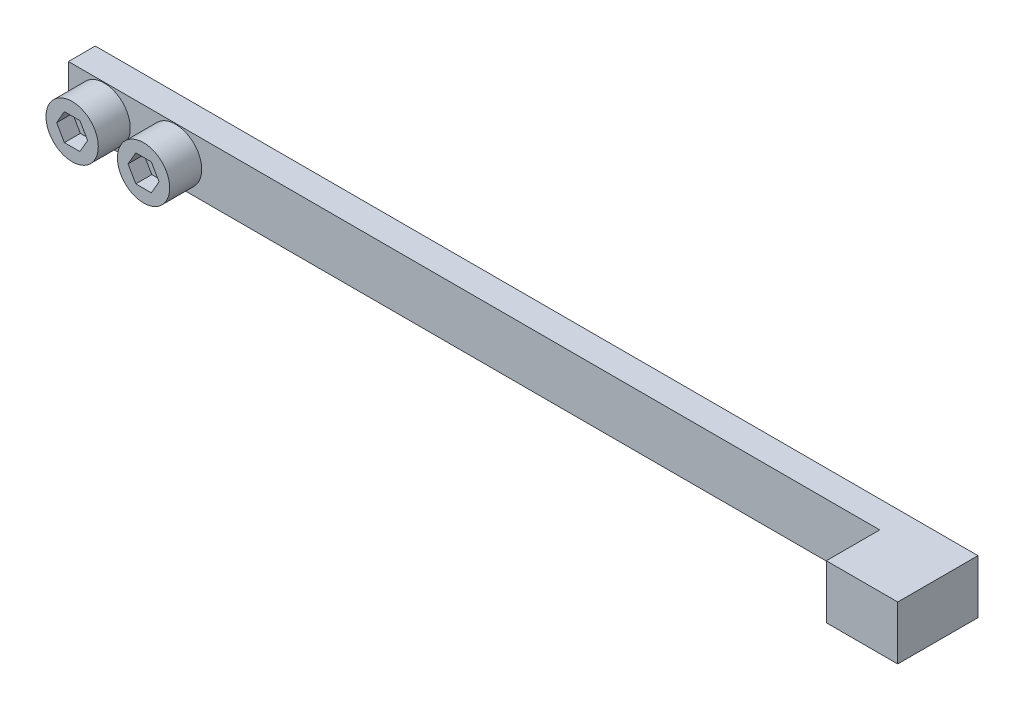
ISO-10303-21;
HEADER;
FILE_DESCRIPTION(('STEP AP214'),'2;1');
FILE_NAME('part.step','',(''),(''),'','','');
FILE_SCHEMA(('AUTOMOTIVE_DESIGN { 1 0 10303 214 1 1 1 1 }'));
ENDSEC;
DATA;
#1=APPLICATION_CONTEXT('core data for automotive mechanical design processes');
#2=APPLICATION_PROTOCOL_DEFINITION('international standard','automotive_design',2000,#1);
#3=PRODUCT_CONTEXT('',#1,'mechanical');
#4=PRODUCT('Part','Part','',(#3));
#5=PRODUCT_RELATED_PRODUCT_CATEGORY('part','',(#4));
#6=PRODUCT_DEFINITION_FORMATION('','',#4);
#7=PRODUCT_DEFINITION_CONTEXT('part definition',#1,'design');
#8=PRODUCT_DEFINITION('design','',#6,#7);
#9=PRODUCT_DEFINITION_SHAPE('','',#8);
#10=(LENGTH_UNIT() NAMED_UNIT(*) SI_UNIT(.MILLI.,.METRE.));
#11=(NAMED_UNIT(*) PLANE_ANGLE_UNIT() SI_UNIT($,.RADIAN.));
#12=(NAMED_UNIT(*) SI_UNIT($,.STERADIAN.) SOLID_ANGLE_UNIT());
#13=UNCERTAINTY_MEASURE_WITH_UNIT(LENGTH_MEASURE(1.E-05),#10,'distance_accuracy_value','');
#14=(GEOMETRIC_REPRESENTATION_CONTEXT(3) GLOBAL_UNCERTAINTY_ASSIGNED_CONTEXT((#13)) GLOBAL_UNIT_ASSIGNED_CONTEXT((#10,
#11,#12)) REPRESENTATION_CONTEXT('',''));
#15=CARTESIAN_POINT('',(0.,0.,0.));
#16=DIRECTION('',(0.,0.,1.));
#17=DIRECTION('',(1.,0.,0.));
#18=AXIS2_PLACEMENT_3D('',#15,#16,#17);
#19=CARTESIAN_POINT('',(-38.4048,2.3876,1.1938));
#20=DIRECTION('',(0.,0.,-1.));
#21=DIRECTION('',(-1.,0.,0.));
#22=AXIS2_PLACEMENT_3D('',#19,#20,#21);
#23=PLANE('',#22);
#24=CARTESIAN_POINT('',(-35.2298,0.,1.1938));
#25=DIRECTION('',(0.,0.,-1.));
#26=DIRECTION('',(-1.,0.,0.));
#27=AXIS2_PLACEMENT_3D('',#24,#25,#26);
#28=CIRCLE('',#27,2.3241);
#29=CARTESIAN_POINT('',(-37.5539,0.,1.1938));
#30=VERTEX_POINT('',#29);
#31=EDGE_CURVE('E41',#30,#30,#28,.F.);
#32=ORIENTED_EDGE('',*,*,#31,.F.);
#33=EDGE_LOOP('',(#32));
#34=FACE_BOUND('',#33,.T.);
#35=DIRECTION('',(1.,0.,0.));
#36=VECTOR('',#35,1.);
#37=CARTESIAN_POINT('',(-38.4048,-2.3876,1.1938));
#38=LINE('',#37,#36);
#39=CARTESIAN_POINT('',(-38.4048,-2.3876,1.1938));
#40=VERTEX_POINT('',#39);
#41=CARTESIAN_POINT('',(33.7312,-2.3876,1.1938));
#42=VERTEX_POINT('',#41);
#43=EDGE_CURVE('E284',#40,#42,#38,.T.);
#44=ORIENTED_EDGE('',*,*,#43,.T.);
#45=DIRECTION('',(0.,-1.,0.));
#46=VECTOR('',#45,1.);
#47=CARTESIAN_POINT('',(33.7312,2.3876,1.1938));
#48=LINE('',#47,#46);
#49=CARTESIAN_POINT('',(33.7312,2.3876,1.1938));
#50=VERTEX_POINT('',#49);
#51=EDGE_CURVE('E299',#50,#42,#48,.T.);
#52=ORIENTED_EDGE('',*,*,#51,.F.);
#53=DIRECTION('',(1.,0.,0.));
#54=VECTOR('',#53,1.);
#55=CARTESIAN_POINT('',(-38.4048,2.3876,1.1938));
#56=LINE('',#55,#54);
#57=CARTESIAN_POINT('',(-38.4048,2.3876,1.1938));
#58=VERTEX_POINT('',#57);
#59=EDGE_CURVE('E271',#58,#50,#56,.T.);
#60=ORIENTED_EDGE('',*,*,#59,.F.);
#61=DIRECTION('',(0.,-1.,0.));
#62=VECTOR('',#61,1.);
#63=CARTESIAN_POINT('',(-38.4048,2.3876,1.1938));
#64=LINE('',#63,#62);
#65=EDGE_CURVE('E302',#58,#40,#64,.T.);
#66=ORIENTED_EDGE('',*,*,#65,.T.);
#67=EDGE_LOOP('',(#44,#52,#60,#66));
#68=FACE_BOUND('',#67,.T.);
#69=CARTESIAN_POINT('',(-28.8798,0.,1.1938));
#70=DIRECTION('',(0.,0.,-1.));
#71=DIRECTION('',(-1.,0.,0.));
#72=AXIS2_PLACEMENT_3D('',#69,#70,#71);
#73=CIRCLE('',#72,2.3241);
#74=CARTESIAN_POINT('',(-31.2039,0.,1.1938));
#75=VERTEX_POINT('',#74);
#76=EDGE_CURVE('E11',#75,#75,#73,.F.);
#77=ORIENTED_EDGE('',*,*,#76,.F.);
#78=EDGE_LOOP('',(#77));
#79=FACE_BOUND('',#78,.T.);
#80=ADVANCED_FACE('F33',(#34,#68,#79),#23,.F.);
#81=CARTESIAN_POINT('',(40.0812,2.3876,-1.1938));
#82=DIRECTION('',(0.,0.,1.));
#83=DIRECTION('',(1.,0.,0.));
#84=AXIS2_PLACEMENT_3D('',#81,#82,#83);
#85=PLANE('',#84);
#86=DIRECTION('',(-1.,0.,0.));
#87=VECTOR('',#86,1.);
#88=CARTESIAN_POINT('',(40.0812,-2.3876,-1.1938));
#89=LINE('',#88,#87);
#90=CARTESIAN_POINT('',(40.0812,-2.3876,-1.1938));
#91=VERTEX_POINT('',#90);
#92=CARTESIAN_POINT('',(-38.4048,-2.3876,-1.1938));
#93=VERTEX_POINT('',#92);
#94=EDGE_CURVE('E264',#91,#93,#89,.T.);
#95=ORIENTED_EDGE('',*,*,#94,.T.);
#96=DIRECTION('',(0.,-1.,0.));
#97=VECTOR('',#96,1.);
#98=CARTESIAN_POINT('',(-38.4048,2.3876,-1.1938));
#99=LINE('',#98,#97);
#100=CARTESIAN_POINT('',(-38.4048,2.3876,-1.1938));
#101=VERTEX_POINT('',#100);
#102=EDGE_CURVE('E305',#101,#93,#99,.T.);
#103=ORIENTED_EDGE('',*,*,#102,.F.);
#104=DIRECTION('',(-1.,0.,0.));
#105=VECTOR('',#104,1.);
#106=CARTESIAN_POINT('',(40.0812,2.3876,-1.1938));
#107=LINE('',#106,#105);
#108=CARTESIAN_POINT('',(40.0812,2.3876,-1.1938));
#109=VERTEX_POINT('',#108);
#110=EDGE_CURVE('E265',#109,#101,#107,.T.);
#111=ORIENTED_EDGE('',*,*,#110,.F.);
#112=DIRECTION('',(0.,-1.,0.));
#113=VECTOR('',#112,1.);
#114=CARTESIAN_POINT('',(40.0812,2.3876,-1.1938));
#115=LINE('',#114,#113);
#116=EDGE_CURVE('E279',#109,#91,#115,.T.);
#117=ORIENTED_EDGE('',*,*,#116,.T.);
#118=EDGE_LOOP('',(#95,#103,#111,#117));
#119=FACE_BOUND('',#118,.T.);
#120=ADVANCED_FACE('F35',(#119),#85,.F.);
#121=CARTESIAN_POINT('',(-38.4048,2.3876,-1.1938));
#122=DIRECTION('',(1.,0.,0.));
#123=DIRECTION('',(0.,0.,-1.));
#124=AXIS2_PLACEMENT_3D('',#121,#122,#123);
#125=PLANE('',#124);
#126=DIRECTION('',(0.,0.,1.));
#127=VECTOR('',#126,1.);
#128=CARTESIAN_POINT('',(-38.4048,-2.3876,-1.1938));
#129=LINE('',#128,#127);
#130=EDGE_CURVE('E282',#93,#40,#129,.T.);
#131=ORIENTED_EDGE('',*,*,#130,.T.);
#132=ORIENTED_EDGE('',*,*,#65,.F.);
#133=DIRECTION('',(0.,0.,1.));
#134=VECTOR('',#133,1.);
#135=CARTESIAN_POINT('',(-38.4048,2.3876,-1.1938));
#136=LINE('',#135,#134);
#137=EDGE_CURVE('E268',#101,#58,#136,.T.);
#138=ORIENTED_EDGE('',*,*,#137,.F.);
#139=ORIENTED_EDGE('',*,*,#102,.T.);
#140=EDGE_LOOP('',(#131,#132,#138,#139));
#141=FACE_BOUND('',#140,.T.);
#142=ADVANCED_FACE('F359',(#141),#125,.F.);
#143=CARTESIAN_POINT('',(33.7312,2.3876,1.1938));
#144=DIRECTION('',(1.,0.,0.));
#145=DIRECTION('',(0.,0.,-1.));
#146=AXIS2_PLACEMENT_3D('',#143,#144,#145);
#147=PLANE('',#146);
#148=DIRECTION('',(0.,0.,1.));
#149=VECTOR('',#148,1.);
#150=CARTESIAN_POINT('',(33.7312,-2.3876,1.1938));
#151=LINE('',#150,#149);
#152=CARTESIAN_POINT('',(33.7312,-2.3876,5.9436));
#153=VERTEX_POINT('',#152);
#154=EDGE_CURVE('E286',#42,#153,#151,.T.);
#155=ORIENTED_EDGE('',*,*,#154,.T.);
#156=DIRECTION('',(0.,-1.,0.));
#157=VECTOR('',#156,1.);
#158=CARTESIAN_POINT('',(33.7312,2.3876,5.9436));
#159=LINE('',#158,#157);
#160=CARTESIAN_POINT('',(33.7312,2.3876,5.9436));
#161=VERTEX_POINT('',#160);
#162=EDGE_CURVE('E296',#161,#153,#159,.T.);
#163=ORIENTED_EDGE('',*,*,#162,.F.);
#164=DIRECTION('',(0.,0.,1.));
#165=VECTOR('',#164,1.);
#166=CARTESIAN_POINT('',(33.7312,2.3876,1.1938));
#167=LINE('',#166,#165);
#168=EDGE_CURVE('E273',#50,#161,#167,.T.);
#169=ORIENTED_EDGE('',*,*,#168,.F.);
#170=ORIENTED_EDGE('',*,*,#51,.T.);
#171=EDGE_LOOP('',(#155,#163,#169,#170));
#172=FACE_BOUND('',#171,.T.);
#173=ADVANCED_FACE('F356',(#172),#147,.F.);
#174=CARTESIAN_POINT('',(33.7312,2.3876,5.9436));
#175=DIRECTION('',(0.,0.,-1.));
#176=DIRECTION('',(-1.,0.,0.));
#177=AXIS2_PLACEMENT_3D('',#174,#175,#176);
#178=PLANE('',#177);
#179=DIRECTION('',(1.,0.,0.));
#180=VECTOR('',#179,1.);
#181=CARTESIAN_POINT('',(33.7312,-2.3876,5.9436));
#182=LINE('',#181,#180);
#183=CARTESIAN_POINT('',(40.0812,-2.3876,5.9436));
#184=VERTEX_POINT('',#183);
#185=EDGE_CURVE('E288',#153,#184,#182,.T.);
#186=ORIENTED_EDGE('',*,*,#185,.T.);
#187=DIRECTION('',(0.,-1.,0.));
#188=VECTOR('',#187,1.);
#189=CARTESIAN_POINT('',(40.0812,2.3876,5.9436));
#190=LINE('',#189,#188);
#191=CARTESIAN_POINT('',(40.0812,2.3876,5.9436));
#192=VERTEX_POINT('',#191);
#193=EDGE_CURVE('E293',#192,#184,#190,.T.);
#194=ORIENTED_EDGE('',*,*,#193,.F.);
#195=DIRECTION('',(1.,0.,0.));
#196=VECTOR('',#195,1.);
#197=CARTESIAN_POINT('',(33.7312,2.3876,5.9436));
#198=LINE('',#197,#196);
#199=EDGE_CURVE('E275',#161,#192,#198,.T.);
#200=ORIENTED_EDGE('',*,*,#199,.F.);
#201=ORIENTED_EDGE('',*,*,#162,.T.);
#202=EDGE_LOOP('',(#186,#194,#200,#201));
#203=FACE_BOUND('',#202,.T.);
#204=ADVANCED_FACE('F352',(#203),#178,.F.);
#205=CARTESIAN_POINT('',(40.0812,2.3876,5.9436));
#206=DIRECTION('',(-1.,0.,0.));
#207=DIRECTION('',(0.,0.,1.));
#208=AXIS2_PLACEMENT_3D('',#205,#206,#207);
#209=PLANE('',#208);
#210=DIRECTION('',(0.,0.,-1.));
#211=VECTOR('',#210,1.);
#212=CARTESIAN_POINT('',(40.0812,-2.3876,5.9436));
#213=LINE('',#212,#211);
#214=EDGE_CURVE('E269',#184,#91,#213,.T.);
#215=ORIENTED_EDGE('',*,*,#214,.T.);
#216=ORIENTED_EDGE('',*,*,#116,.F.);
#217=DIRECTION('',(0.,0.,-1.));
#218=VECTOR('',#217,1.);
#219=CARTESIAN_POINT('',(40.0812,2.3876,5.9436));
#220=LINE('',#219,#218);
#221=EDGE_CURVE('E277',#192,#109,#220,.T.);
#222=ORIENTED_EDGE('',*,*,#221,.F.);
#223=ORIENTED_EDGE('',*,*,#193,.T.);
#224=EDGE_LOOP('',(#215,#216,#222,#223));
#225=FACE_BOUND('',#224,.T.);
#226=ADVANCED_FACE('F345',(#225),#209,.F.);
#227=CARTESIAN_POINT('',(-38.4048,2.3876,-1.1938));
#228=DIRECTION('',(0.,1.,0.));
#229=DIRECTION('',(0.,0.,1.));
#230=AXIS2_PLACEMENT_3D('',#227,#228,#229);
#231=PLANE('',#230);
#232=ORIENTED_EDGE('',*,*,#110,.T.);
#233=ORIENTED_EDGE('',*,*,#137,.T.);
#234=ORIENTED_EDGE('',*,*,#59,.T.);
#235=ORIENTED_EDGE('',*,*,#168,.T.);
#236=ORIENTED_EDGE('',*,*,#199,.T.);
#237=ORIENTED_EDGE('',*,*,#221,.T.);
#238=EDGE_LOOP('',(#232,#233,#234,#235,#236,#237));
#239=FACE_BOUND('',#238,.T.);
#240=ADVANCED_FACE('F342',(#239),#231,.T.);
#241=CARTESIAN_POINT('',(-38.4048,-2.3876,-1.1938));
#242=DIRECTION('',(0.,1.,0.));
#243=DIRECTION('',(0.,0.,1.));
#244=AXIS2_PLACEMENT_3D('',#241,#242,#243);
#245=PLANE('',#244);
#246=ORIENTED_EDGE('',*,*,#94,.F.);
#247=ORIENTED_EDGE('',*,*,#214,.F.);
#248=ORIENTED_EDGE('',*,*,#185,.F.);
#249=ORIENTED_EDGE('',*,*,#154,.F.);
#250=ORIENTED_EDGE('',*,*,#43,.F.);
#251=ORIENTED_EDGE('',*,*,#130,.F.);
#252=EDGE_LOOP('',(#246,#247,#248,#249,#250,#251));
#253=FACE_BOUND('',#252,.T.);
#254=ADVANCED_FACE('F340',(#253),#245,.F.);
#255=CARTESIAN_POINT('',(-35.2298,0.,4.0386));
#256=DIRECTION('',(0.,0.,-1.));
#257=DIRECTION('',(-1.,0.,0.));
#258=AXIS2_PLACEMENT_3D('',#255,#256,#257);
#259=CYLINDRICAL_SURFACE('',#258,2.3241);
#260=CARTESIAN_POINT('',(-35.2298,0.,4.0386));
#261=DIRECTION('',(0.,0.,1.));
#262=DIRECTION('',(1.,0.,0.));
#263=AXIS2_PLACEMENT_3D('',#260,#261,#262);
#264=CIRCLE('',#263,2.3241);
#265=CARTESIAN_POINT('',(-32.9057,0.,4.0386));
#266=VERTEX_POINT('',#265);
#267=EDGE_CURVE('E261',#266,#266,#264,.T.);
#268=ORIENTED_EDGE('',*,*,#267,.F.);
#269=EDGE_LOOP('',(#268));
#270=FACE_BOUND('',#269,.T.);
#271=ORIENTED_EDGE('',*,*,#31,.T.);
#272=EDGE_LOOP('',(#271));
#273=FACE_BOUND('',#272,.T.);
#274=ADVANCED_FACE('F310',(#270,#273),#259,.T.);
#275=CARTESIAN_POINT('',(-35.2298,0.,4.0386));
#276=DIRECTION('',(0.,0.,1.));
#277=DIRECTION('',(1.,0.,0.));
#278=AXIS2_PLACEMENT_3D('',#275,#276,#277);
#279=PLANE('',#278);
#280=DIRECTION('',(-0.500000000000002,-0.866025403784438,0.));
#281=VECTOR('',#280,1.);
#282=CARTESIAN_POINT('',(-27.4562111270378,15.8518508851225,4.0386));
#283=LINE('',#282,#281);
#284=CARTESIAN_POINT('',(-35.9190407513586,1.1938,4.0386));
#285=VERTEX_POINT('',#284);
#286=CARTESIAN_POINT('',(-36.6082815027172,0.,4.0386));
#287=VERTEX_POINT('',#286);
#288=EDGE_CURVE('E56',#285,#287,#283,.T.);
#289=ORIENTED_EDGE('',*,*,#288,.F.);
#290=DIRECTION('',(-1.,0.,0.));
#291=VECTOR('',#290,1.);
#292=CARTESIAN_POINT('',(0.,1.1938,4.0386));
#293=LINE('',#292,#291);
#294=CARTESIAN_POINT('',(-34.5405592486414,1.1938,4.0386));
#295=VERTEX_POINT('',#294);
#296=EDGE_CURVE('E216',#295,#285,#293,.T.);
#297=ORIENTED_EDGE('',*,*,#296,.F.);
#298=DIRECTION('',(-0.500000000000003,0.866025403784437,0.));
#299=VECTOR('',#298,1.);
#300=CARTESIAN_POINT('',(-25.388488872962,-14.6580508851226,4.0386));
#301=LINE('',#300,#299);
#302=CARTESIAN_POINT('',(-33.8513184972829,0.,4.0386));
#303=VERTEX_POINT('',#302);
#304=EDGE_CURVE('E242',#303,#295,#301,.T.);
#305=ORIENTED_EDGE('',*,*,#304,.F.);
#306=DIRECTION('',(0.500000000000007,0.866025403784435,0.));
#307=VECTOR('',#306,1.);
#308=CARTESIAN_POINT('',(-25.3884888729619,14.6580508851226,4.0386));
#309=LINE('',#308,#307);
#310=CARTESIAN_POINT('',(-34.5405592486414,-1.1938,4.0386));
#311=VERTEX_POINT('',#310);
#312=EDGE_CURVE('E239',#311,#303,#309,.T.);
#313=ORIENTED_EDGE('',*,*,#312,.F.);
#314=DIRECTION('',(1.,0.,0.));
#315=VECTOR('',#314,1.);
#316=CARTESIAN_POINT('',(0.,-1.19379999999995,4.0386));
#317=LINE('',#316,#315);
#318=CARTESIAN_POINT('',(-35.9190407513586,-1.1938,4.0386));
#319=VERTEX_POINT('',#318);
#320=EDGE_CURVE('E236',#319,#311,#317,.T.);
#321=ORIENTED_EDGE('',*,*,#320,.F.);
#322=DIRECTION('',(0.500000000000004,-0.866025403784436,0.));
#323=VECTOR('',#322,1.);
#324=CARTESIAN_POINT('',(-27.4562111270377,-15.8518508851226,4.0386));
#325=LINE('',#324,#323);
#326=EDGE_CURVE('E233',#287,#319,#325,.T.);
#327=ORIENTED_EDGE('',*,*,#326,.F.);
#328=EDGE_LOOP('',(#289,#297,#305,#313,#321,#327));
#329=FACE_BOUND('',#328,.T.);
#330=ORIENTED_EDGE('',*,*,#267,.T.);
#331=EDGE_LOOP('',(#330));
#332=FACE_BOUND('',#331,.T.);
#333=ADVANCED_FACE('F323',(#329,#332),#279,.T.);
#334=CARTESIAN_POINT('',(-28.8798,0.,4.0386));
#335=DIRECTION('',(0.,0.,-1.));
#336=DIRECTION('',(-1.,0.,0.));
#337=AXIS2_PLACEMENT_3D('',#334,#335,#336);
#338=CYLINDRICAL_SURFACE('',#337,2.3241);
#339=CARTESIAN_POINT('',(-28.8798,0.,4.0386));
#340=DIRECTION('',(0.,0.,1.));
#341=DIRECTION('',(1.,0.,0.));
#342=AXIS2_PLACEMENT_3D('',#339,#340,#341);
#343=CIRCLE('',#342,2.3241);
#344=CARTESIAN_POINT('',(-26.5557,0.,4.0386));
#345=VERTEX_POINT('',#344);
#346=EDGE_CURVE('E249',#345,#345,#343,.T.);
#347=ORIENTED_EDGE('',*,*,#346,.F.);
#348=EDGE_LOOP('',(#347));
#349=FACE_BOUND('',#348,.T.);
#350=ORIENTED_EDGE('',*,*,#76,.T.);
#351=EDGE_LOOP('',(#350));
#352=FACE_BOUND('',#351,.T.);
#353=ADVANCED_FACE('F320',(#349,#352),#338,.T.);
#354=CARTESIAN_POINT('',(-28.8798,0.,4.0386));
#355=DIRECTION('',(0.,0.,1.));
#356=DIRECTION('',(1.,0.,0.));
#357=AXIS2_PLACEMENT_3D('',#354,#355,#356);
#358=PLANE('',#357);
#359=DIRECTION('',(0.499999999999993,-0.866025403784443,0.));
#360=VECTOR('',#359,1.);
#361=CARTESIAN_POINT('',(-22.6937111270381,-13.1022202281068,4.0386));
#362=LINE('',#361,#360);
#363=CARTESIAN_POINT('',(-30.2582815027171,0.,4.0386));
#364=VERTEX_POINT('',#363);
#365=CARTESIAN_POINT('',(-29.5690407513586,-1.1938,4.0386));
#366=VERTEX_POINT('',#365);
#367=EDGE_CURVE('E48',#364,#366,#362,.T.);
#368=ORIENTED_EDGE('',*,*,#367,.F.);
#369=DIRECTION('',(-0.499999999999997,-0.86602540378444,0.));
#370=VECTOR('',#369,1.);
#371=CARTESIAN_POINT('',(-22.693711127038,13.1022202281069,4.0386));
#372=LINE('',#371,#370);
#373=CARTESIAN_POINT('',(-29.5690407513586,1.1938,4.0386));
#374=VERTEX_POINT('',#373);
#375=EDGE_CURVE('E179',#374,#364,#372,.T.);
#376=ORIENTED_EDGE('',*,*,#375,.F.);
#377=DIRECTION('',(-1.,0.,0.));
#378=VECTOR('',#377,1.);
#379=CARTESIAN_POINT('',(0.,1.19379999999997,4.0386));
#380=LINE('',#379,#378);
#381=CARTESIAN_POINT('',(-28.1905592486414,1.1938,4.0386));
#382=VERTEX_POINT('',#381);
#383=EDGE_CURVE('E182',#382,#374,#380,.T.);
#384=ORIENTED_EDGE('',*,*,#383,.F.);
#385=DIRECTION('',(-0.500000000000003,0.866025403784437,0.));
#386=VECTOR('',#385,1.);
#387=CARTESIAN_POINT('',(-20.6259888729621,-11.908420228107,4.0386));
#388=LINE('',#387,#386);
#389=CARTESIAN_POINT('',(-27.5013184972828,0.,4.0386));
#390=VERTEX_POINT('',#389);
#391=EDGE_CURVE('E198',#390,#382,#388,.T.);
#392=ORIENTED_EDGE('',*,*,#391,.F.);
#393=DIRECTION('',(0.500000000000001,0.866025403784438,0.));
#394=VECTOR('',#393,1.);
#395=CARTESIAN_POINT('',(-20.6259888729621,11.9084202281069,4.0386));
#396=LINE('',#395,#394);
#397=CARTESIAN_POINT('',(-28.1905592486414,-1.1938,4.0386));
#398=VERTEX_POINT('',#397);
#399=EDGE_CURVE('E195',#398,#390,#396,.T.);
#400=ORIENTED_EDGE('',*,*,#399,.F.);
#401=DIRECTION('',(1.,0.,0.));
#402=VECTOR('',#401,1.);
#403=CARTESIAN_POINT('',(0.,-1.1938,4.0386));
#404=LINE('',#403,#402);
#405=EDGE_CURVE('E193',#366,#398,#404,.T.);
#406=ORIENTED_EDGE('',*,*,#405,.F.);
#407=EDGE_LOOP('',(#368,#376,#384,#392,#400,#406));
#408=FACE_BOUND('',#407,.T.);
#409=ORIENTED_EDGE('',*,*,#346,.T.);
#410=EDGE_LOOP('',(#409));
#411=FACE_BOUND('',#410,.T.);
#412=ADVANCED_FACE('F322',(#408,#411),#358,.T.);
#413=CARTESIAN_POINT('',(-27.4562111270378,15.8518508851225,2.6162));
#414=DIRECTION('',(-0.866025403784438,0.500000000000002,0.));
#415=DIRECTION('',(-0.500000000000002,-0.866025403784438,0.));
#416=AXIS2_PLACEMENT_3D('',#413,#414,#415);
#417=PLANE('',#416);
#418=ORIENTED_EDGE('',*,*,#288,.T.);
#419=DIRECTION('',(0.,0.,1.));
#420=VECTOR('',#419,1.);
#421=CARTESIAN_POINT('',(-36.6082815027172,0.,2.6162));
#422=LINE('',#421,#420);
#423=CARTESIAN_POINT('',(-36.6082815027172,0.,2.6162));
#424=VERTEX_POINT('',#423);
#425=EDGE_CURVE('E231',#424,#287,#422,.T.);
#426=ORIENTED_EDGE('',*,*,#425,.F.);
#427=DIRECTION('',(-0.500000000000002,-0.866025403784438,0.));
#428=VECTOR('',#427,1.);
#429=CARTESIAN_POINT('',(-27.4562111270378,15.8518508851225,2.6162));
#430=LINE('',#429,#428);
#431=CARTESIAN_POINT('',(-35.9190407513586,1.1938,2.6162));
#432=VERTEX_POINT('',#431);
#433=EDGE_CURVE('E212',#432,#424,#430,.T.);
#434=ORIENTED_EDGE('',*,*,#433,.F.);
#435=DIRECTION('',(0.,0.,1.));
#436=VECTOR('',#435,1.);
#437=CARTESIAN_POINT('',(-35.9190407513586,1.1938,2.6162));
#438=LINE('',#437,#436);
#439=EDGE_CURVE('E247',#432,#285,#438,.T.);
#440=ORIENTED_EDGE('',*,*,#439,.T.);
#441=EDGE_LOOP('',(#418,#426,#434,#440));
#442=FACE_BOUND('',#441,.T.);
#443=ADVANCED_FACE('F330',(#442),#417,.F.);
#444=CARTESIAN_POINT('',(0.,1.1938,2.6162));
#445=DIRECTION('',(0.,1.,0.));
#446=DIRECTION('',(0.,0.,1.));
#447=AXIS2_PLACEMENT_3D('',#444,#445,#446);
#448=PLANE('',#447);
#449=ORIENTED_EDGE('',*,*,#296,.T.);
#450=ORIENTED_EDGE('',*,*,#439,.F.);
#451=DIRECTION('',(-1.,0.,0.));
#452=VECTOR('',#451,1.);
#453=CARTESIAN_POINT('',(0.,1.1938,2.6162));
#454=LINE('',#453,#452);
#455=CARTESIAN_POINT('',(-34.5405592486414,1.1938,2.6162));
#456=VERTEX_POINT('',#455);
#457=EDGE_CURVE('E228',#456,#432,#454,.T.);
#458=ORIENTED_EDGE('',*,*,#457,.F.);
#459=DIRECTION('',(0.,0.,1.));
#460=VECTOR('',#459,1.);
#461=CARTESIAN_POINT('',(-34.5405592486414,1.1938,2.6162));
#462=LINE('',#461,#460);
#463=EDGE_CURVE('E250',#456,#295,#462,.T.);
#464=ORIENTED_EDGE('',*,*,#463,.T.);
#465=EDGE_LOOP('',(#449,#450,#458,#464));
#466=FACE_BOUND('',#465,.T.);
#467=ADVANCED_FACE('F422',(#466),#448,.F.);
#468=CARTESIAN_POINT('',(-25.388488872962,-14.6580508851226,2.6162));
#469=DIRECTION('',(0.866025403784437,0.500000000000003,0.));
#470=DIRECTION('',(-0.500000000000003,0.866025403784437,0.));
#471=AXIS2_PLACEMENT_3D('',#468,#469,#470);
#472=PLANE('',#471);
#473=ORIENTED_EDGE('',*,*,#304,.T.);
#474=ORIENTED_EDGE('',*,*,#463,.F.);
#475=DIRECTION('',(-0.500000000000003,0.866025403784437,0.));
#476=VECTOR('',#475,1.);
#477=CARTESIAN_POINT('',(-25.388488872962,-14.6580508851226,2.6162));
#478=LINE('',#477,#476);
#479=CARTESIAN_POINT('',(-33.8513184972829,0.,2.6162));
#480=VERTEX_POINT('',#479);
#481=EDGE_CURVE('E225',#480,#456,#478,.T.);
#482=ORIENTED_EDGE('',*,*,#481,.F.);
#483=DIRECTION('',(0.,0.,1.));
#484=VECTOR('',#483,1.);
#485=CARTESIAN_POINT('',(-33.8513184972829,0.,2.6162));
#486=LINE('',#485,#484);
#487=EDGE_CURVE('E252',#480,#303,#486,.T.);
#488=ORIENTED_EDGE('',*,*,#487,.T.);
#489=EDGE_LOOP('',(#473,#474,#482,#488));
#490=FACE_BOUND('',#489,.T.);
#491=ADVANCED_FACE('F430',(#490),#472,.F.);
#492=CARTESIAN_POINT('',(-25.3884888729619,14.6580508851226,2.6162));
#493=DIRECTION('',(0.866025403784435,-0.500000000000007,0.));
#494=DIRECTION('',(0.500000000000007,0.866025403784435,0.));
#495=AXIS2_PLACEMENT_3D('',#492,#493,#494);
#496=PLANE('',#495);
#497=ORIENTED_EDGE('',*,*,#312,.T.);
#498=ORIENTED_EDGE('',*,*,#487,.F.);
#499=DIRECTION('',(0.500000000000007,0.866025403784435,0.));
#500=VECTOR('',#499,1.);
#501=CARTESIAN_POINT('',(-25.3884888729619,14.6580508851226,2.6162));
#502=LINE('',#501,#500);
#503=CARTESIAN_POINT('',(-34.5405592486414,-1.1938,2.6162));
#504=VERTEX_POINT('',#503);
#505=EDGE_CURVE('E222',#504,#480,#502,.T.);
#506=ORIENTED_EDGE('',*,*,#505,.F.);
#507=DIRECTION('',(0.,0.,1.));
#508=VECTOR('',#507,1.);
#509=CARTESIAN_POINT('',(-34.5405592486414,-1.1938,2.6162));
#510=LINE('',#509,#508);
#511=EDGE_CURVE('E254',#504,#311,#510,.T.);
#512=ORIENTED_EDGE('',*,*,#511,.T.);
#513=EDGE_LOOP('',(#497,#498,#506,#512));
#514=FACE_BOUND('',#513,.T.);
#515=ADVANCED_FACE('F440',(#514),#496,.F.);
#516=CARTESIAN_POINT('',(0.,-1.19379999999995,2.6162));
#517=DIRECTION('',(0.,-1.,0.));
#518=DIRECTION('',(1.,0.,0.));
#519=AXIS2_PLACEMENT_3D('',#516,#517,#518);
#520=PLANE('',#519);
#521=ORIENTED_EDGE('',*,*,#320,.T.);
#522=ORIENTED_EDGE('',*,*,#511,.F.);
#523=DIRECTION('',(1.,0.,0.));
#524=VECTOR('',#523,1.);
#525=CARTESIAN_POINT('',(0.,-1.19379999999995,2.6162));
#526=LINE('',#525,#524);
#527=CARTESIAN_POINT('',(-35.9190407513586,-1.1938,2.6162));
#528=VERTEX_POINT('',#527);
#529=EDGE_CURVE('E219',#528,#504,#526,.T.);
#530=ORIENTED_EDGE('',*,*,#529,.F.);
#531=DIRECTION('',(0.,0.,1.));
#532=VECTOR('',#531,1.);
#533=CARTESIAN_POINT('',(-35.9190407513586,-1.1938,2.6162));
#534=LINE('',#533,#532);
#535=EDGE_CURVE('E256',#528,#319,#534,.T.);
#536=ORIENTED_EDGE('',*,*,#535,.T.);
#537=EDGE_LOOP('',(#521,#522,#530,#536));
#538=FACE_BOUND('',#537,.T.);
#539=ADVANCED_FACE('F450',(#538),#520,.F.);
#540=CARTESIAN_POINT('',(-27.4562111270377,-15.8518508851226,2.6162));
#541=DIRECTION('',(-0.866025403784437,-0.500000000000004,0.));
#542=DIRECTION('',(0.500000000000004,-0.866025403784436,0.));
#543=AXIS2_PLACEMENT_3D('',#540,#541,#542);
#544=PLANE('',#543);
#545=ORIENTED_EDGE('',*,*,#326,.T.);
#546=ORIENTED_EDGE('',*,*,#535,.F.);
#547=DIRECTION('',(0.500000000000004,-0.866025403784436,0.));
#548=VECTOR('',#547,1.);
#549=CARTESIAN_POINT('',(-27.4562111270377,-15.8518508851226,2.6162));
#550=LINE('',#549,#548);
#551=EDGE_CURVE('E215',#424,#528,#550,.T.);
#552=ORIENTED_EDGE('',*,*,#551,.F.);
#553=ORIENTED_EDGE('',*,*,#425,.T.);
#554=EDGE_LOOP('',(#545,#546,#552,#553));
#555=FACE_BOUND('',#554,.T.);
#556=ADVANCED_FACE('F460',(#555),#544,.F.);
#557=CARTESIAN_POINT('',(0.,0.,2.6162));
#558=DIRECTION('',(0.,0.,1.));
#559=DIRECTION('',(1.,0.,0.));
#560=AXIS2_PLACEMENT_3D('',#557,#558,#559);
#561=PLANE('',#560);
#562=ORIENTED_EDGE('',*,*,#433,.T.);
#563=ORIENTED_EDGE('',*,*,#551,.T.);
#564=ORIENTED_EDGE('',*,*,#529,.T.);
#565=ORIENTED_EDGE('',*,*,#505,.T.);
#566=ORIENTED_EDGE('',*,*,#481,.T.);
#567=ORIENTED_EDGE('',*,*,#457,.T.);
#568=EDGE_LOOP('',(#562,#563,#564,#565,#566,#567));
#569=FACE_BOUND('',#568,.T.);
#570=ADVANCED_FACE('F470',(#569),#561,.T.);
#571=CARTESIAN_POINT('',(-22.6937111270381,-13.1022202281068,2.6162));
#572=DIRECTION('',(-0.866025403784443,-0.499999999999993,0.));
#573=DIRECTION('',(0.499999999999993,-0.866025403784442,0.));
#574=AXIS2_PLACEMENT_3D('',#571,#572,#573);
#575=PLANE('',#574);
#576=ORIENTED_EDGE('',*,*,#367,.T.);
#577=DIRECTION('',(0.,0.,1.));
#578=VECTOR('',#577,1.);
#579=CARTESIAN_POINT('',(-29.5690407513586,-1.1938,2.6162));
#580=LINE('',#579,#578);
#581=CARTESIAN_POINT('',(-29.5690407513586,-1.1938,2.6162));
#582=VERTEX_POINT('',#581);
#583=EDGE_CURVE('E156',#582,#366,#580,.T.);
#584=ORIENTED_EDGE('',*,*,#583,.F.);
#585=DIRECTION('',(0.499999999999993,-0.866025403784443,0.));
#586=VECTOR('',#585,1.);
#587=CARTESIAN_POINT('',(-22.6937111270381,-13.1022202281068,2.6162));
#588=LINE('',#587,#586);
#589=CARTESIAN_POINT('',(-30.2582815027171,0.,2.6162));
#590=VERTEX_POINT('',#589);
#591=EDGE_CURVE('E160',#590,#582,#588,.T.);
#592=ORIENTED_EDGE('',*,*,#591,.F.);
#593=DIRECTION('',(0.,0.,1.));
#594=VECTOR('',#593,1.);
#595=CARTESIAN_POINT('',(-30.2582815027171,0.,2.6162));
#596=LINE('',#595,#594);
#597=EDGE_CURVE('E203',#590,#364,#596,.T.);
#598=ORIENTED_EDGE('',*,*,#597,.T.);
#599=EDGE_LOOP('',(#576,#584,#592,#598));
#600=FACE_BOUND('',#599,.T.);
#601=ADVANCED_FACE('F158',(#600),#575,.F.);
#602=CARTESIAN_POINT('',(-22.693711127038,13.1022202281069,2.6162));
#603=DIRECTION('',(-0.86602540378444,0.499999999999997,0.));
#604=DIRECTION('',(-0.499999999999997,-0.86602540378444,0.));
#605=AXIS2_PLACEMENT_3D('',#602,#603,#604);
#606=PLANE('',#605);
#607=ORIENTED_EDGE('',*,*,#375,.T.);
#608=ORIENTED_EDGE('',*,*,#597,.F.);
#609=DIRECTION('',(-0.499999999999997,-0.86602540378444,0.));
#610=VECTOR('',#609,1.);
#611=CARTESIAN_POINT('',(-22.693711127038,13.1022202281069,2.6162));
#612=LINE('',#611,#610);
#613=CARTESIAN_POINT('',(-29.5690407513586,1.1938,2.6162));
#614=VERTEX_POINT('',#613);
#615=EDGE_CURVE('E166',#614,#590,#612,.T.);
#616=ORIENTED_EDGE('',*,*,#615,.F.);
#617=DIRECTION('',(0.,0.,1.));
#618=VECTOR('',#617,1.);
#619=CARTESIAN_POINT('',(-29.5690407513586,1.1938,2.6162));
#620=LINE('',#619,#618);
#621=EDGE_CURVE('E205',#614,#374,#620,.T.);
#622=ORIENTED_EDGE('',*,*,#621,.T.);
#623=EDGE_LOOP('',(#607,#608,#616,#622));
#624=FACE_BOUND('',#623,.T.);
#625=ADVANCED_FACE('F489',(#624),#606,.F.);
#626=CARTESIAN_POINT('',(0.,1.19379999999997,2.6162));
#627=DIRECTION('',(0.,1.,0.));
#628=DIRECTION('',(-1.,0.,0.));
#629=AXIS2_PLACEMENT_3D('',#626,#627,#628);
#630=PLANE('',#629);
#631=ORIENTED_EDGE('',*,*,#383,.T.);
#632=ORIENTED_EDGE('',*,*,#621,.F.);
#633=DIRECTION('',(-1.,0.,0.));
#634=VECTOR('',#633,1.);
#635=CARTESIAN_POINT('',(0.,1.19379999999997,2.6162));
#636=LINE('',#635,#634);
#637=CARTESIAN_POINT('',(-28.1905592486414,1.1938,2.6162));
#638=VERTEX_POINT('',#637);
#639=EDGE_CURVE('E189',#638,#614,#636,.T.);
#640=ORIENTED_EDGE('',*,*,#639,.F.);
#641=DIRECTION('',(0.,0.,1.));
#642=VECTOR('',#641,1.);
#643=CARTESIAN_POINT('',(-28.1905592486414,1.1938,2.6162));
#644=LINE('',#643,#642);
#645=EDGE_CURVE('E207',#638,#382,#644,.T.);
#646=ORIENTED_EDGE('',*,*,#645,.T.);
#647=EDGE_LOOP('',(#631,#632,#640,#646));
#648=FACE_BOUND('',#647,.T.);
#649=ADVANCED_FACE('F498',(#648),#630,.F.);
#650=CARTESIAN_POINT('',(-20.6259888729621,-11.908420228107,2.6162));
#651=DIRECTION('',(0.866025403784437,0.500000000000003,0.));
#652=DIRECTION('',(-0.500000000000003,0.866025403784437,0.));
#653=AXIS2_PLACEMENT_3D('',#650,#651,#652);
#654=PLANE('',#653);
#655=ORIENTED_EDGE('',*,*,#391,.T.);
#656=ORIENTED_EDGE('',*,*,#645,.F.);
#657=DIRECTION('',(-0.500000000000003,0.866025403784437,0.));
#658=VECTOR('',#657,1.);
#659=CARTESIAN_POINT('',(-20.6259888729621,-11.908420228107,2.6162));
#660=LINE('',#659,#658);
#661=CARTESIAN_POINT('',(-27.5013184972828,0.,2.6162));
#662=VERTEX_POINT('',#661);
#663=EDGE_CURVE('E186',#662,#638,#660,.T.);
#664=ORIENTED_EDGE('',*,*,#663,.F.);
#665=DIRECTION('',(0.,0.,1.));
#666=VECTOR('',#665,1.);
#667=CARTESIAN_POINT('',(-27.5013184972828,0.,2.6162));
#668=LINE('',#667,#666);
#669=EDGE_CURVE('E209',#662,#390,#668,.T.);
#670=ORIENTED_EDGE('',*,*,#669,.T.);
#671=EDGE_LOOP('',(#655,#656,#664,#670));
#672=FACE_BOUND('',#671,.T.);
#673=ADVANCED_FACE('F508',(#672),#654,.F.);
#674=CARTESIAN_POINT('',(-20.6259888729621,11.9084202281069,2.6162));
#675=DIRECTION('',(0.866025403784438,-0.500000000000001,0.));
#676=DIRECTION('',(0.500000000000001,0.866025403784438,0.));
#677=AXIS2_PLACEMENT_3D('',#674,#675,#676);
#678=PLANE('',#677);
#679=ORIENTED_EDGE('',*,*,#399,.T.);
#680=ORIENTED_EDGE('',*,*,#669,.F.);
#681=DIRECTION('',(0.500000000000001,0.866025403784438,0.));
#682=VECTOR('',#681,1.);
#683=CARTESIAN_POINT('',(-20.6259888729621,11.9084202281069,2.6162));
#684=LINE('',#683,#682);
#685=CARTESIAN_POINT('',(-28.1905592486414,-1.1938,2.6162));
#686=VERTEX_POINT('',#685);
#687=EDGE_CURVE('E174',#686,#662,#684,.T.);
#688=ORIENTED_EDGE('',*,*,#687,.F.);
#689=DIRECTION('',(0.,0.,1.));
#690=VECTOR('',#689,1.);
#691=CARTESIAN_POINT('',(-28.1905592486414,-1.1938,2.6162));
#692=LINE('',#691,#690);
#693=EDGE_CURVE('E165',#686,#398,#692,.T.);
#694=ORIENTED_EDGE('',*,*,#693,.T.);
#695=EDGE_LOOP('',(#679,#680,#688,#694));
#696=FACE_BOUND('',#695,.T.);
#697=ADVANCED_FACE('F518',(#696),#678,.F.);
#698=CARTESIAN_POINT('',(0.,-1.1938,2.6162));
#699=DIRECTION('',(0.,-1.,0.));
#700=DIRECTION('',(0.,0.,-1.));
#701=AXIS2_PLACEMENT_3D('',#698,#699,#700);
#702=PLANE('',#701);
#703=ORIENTED_EDGE('',*,*,#405,.T.);
#704=ORIENTED_EDGE('',*,*,#693,.F.);
#705=DIRECTION('',(1.,0.,0.));
#706=VECTOR('',#705,1.);
#707=CARTESIAN_POINT('',(0.,-1.1938,2.6162));
#708=LINE('',#707,#706);
#709=EDGE_CURVE('E169',#582,#686,#708,.T.);
#710=ORIENTED_EDGE('',*,*,#709,.F.);
#711=ORIENTED_EDGE('',*,*,#583,.T.);
#712=EDGE_LOOP('',(#703,#704,#710,#711));
#713=FACE_BOUND('',#712,.T.);
#714=ADVANCED_FACE('F170',(#713),#702,.F.);
#715=CARTESIAN_POINT('',(0.,0.,2.6162));
#716=DIRECTION('',(0.,0.,1.));
#717=DIRECTION('',(1.,0.,0.));
#718=AXIS2_PLACEMENT_3D('',#715,#716,#717);
#719=PLANE('',#718);
#720=ORIENTED_EDGE('',*,*,#591,.T.);
#721=ORIENTED_EDGE('',*,*,#709,.T.);
#722=ORIENTED_EDGE('',*,*,#687,.T.);
#723=ORIENTED_EDGE('',*,*,#663,.T.);
#724=ORIENTED_EDGE('',*,*,#639,.T.);
#725=ORIENTED_EDGE('',*,*,#615,.T.);
#726=EDGE_LOOP('',(#720,#721,#722,#723,#724,#725));
#727=FACE_BOUND('',#726,.T.);
#728=ADVANCED_FACE('F176',(#727),#719,.T.);
#729=CLOSED_SHELL('',(#80,#120,#142,#173,#204,#226,#240,#254,#274,#333,#353,#412,#443,#467,#491,
#515,#539,#556,#570,#601,#625,#649,#673,#697,#714,#728));
#730=MANIFOLD_SOLID_BREP('B2',#729);
#731=ADVANCED_BREP_SHAPE_REPRESENTATION('',(#18,#730),#14);
#732=SHAPE_DEFINITION_REPRESENTATION(#9,#731);
ENDSEC;
END-ISO-10303-21;
